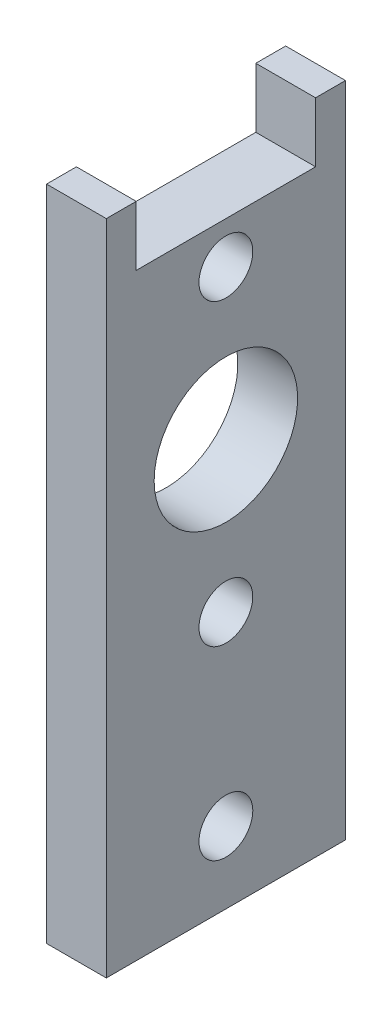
ISO-10303-21;
HEADER;
FILE_DESCRIPTION(('STEP AP214'),'2;1');
FILE_NAME('part.step','',(''),(''),'','','');
FILE_SCHEMA(('AUTOMOTIVE_DESIGN { 1 0 10303 214 1 1 1 1 }'));
ENDSEC;
DATA;
#1=APPLICATION_CONTEXT('core data for automotive mechanical design processes');
#2=APPLICATION_PROTOCOL_DEFINITION('international standard','automotive_design',2000,#1);
#3=PRODUCT_CONTEXT('',#1,'mechanical');
#4=PRODUCT('Part','Part','',(#3));
#5=PRODUCT_RELATED_PRODUCT_CATEGORY('part','',(#4));
#6=PRODUCT_DEFINITION_FORMATION('','',#4);
#7=PRODUCT_DEFINITION_CONTEXT('part definition',#1,'design');
#8=PRODUCT_DEFINITION('design','',#6,#7);
#9=PRODUCT_DEFINITION_SHAPE('','',#8);
#10=(LENGTH_UNIT() NAMED_UNIT(*) SI_UNIT(.MILLI.,.METRE.));
#11=(NAMED_UNIT(*) PLANE_ANGLE_UNIT() SI_UNIT($,.RADIAN.));
#12=(NAMED_UNIT(*) SI_UNIT($,.STERADIAN.) SOLID_ANGLE_UNIT());
#13=UNCERTAINTY_MEASURE_WITH_UNIT(LENGTH_MEASURE(1.E-05),#10,'distance_accuracy_value','');
#14=(GEOMETRIC_REPRESENTATION_CONTEXT(3) GLOBAL_UNCERTAINTY_ASSIGNED_CONTEXT((#13)) GLOBAL_UNIT_ASSIGNED_CONTEXT((#10,
#11,#12)) REPRESENTATION_CONTEXT('',''));
#15=CARTESIAN_POINT('',(0.,0.,0.));
#16=DIRECTION('',(0.,0.,1.));
#17=DIRECTION('',(1.,0.,0.));
#18=AXIS2_PLACEMENT_3D('',#15,#16,#17);
#19=CARTESIAN_POINT('',(-2.5,50.,-9.99999999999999));
#20=DIRECTION('',(1.,0.,0.));
#21=DIRECTION('',(0.,0.,-1.));
#22=AXIS2_PLACEMENT_3D('',#19,#20,#21);
#23=PLANE('',#22);
#24=DIRECTION('',(0.,1.,0.));
#25=VECTOR('',#24,1.);
#26=CARTESIAN_POINT('',(-2.5,50.,10.));
#27=LINE('',#26,#25);
#28=CARTESIAN_POINT('',(-2.5,0.,10.));
#29=VERTEX_POINT('',#28);
#30=CARTESIAN_POINT('',(-2.5,55.,10.));
#31=VERTEX_POINT('',#30);
#32=EDGE_CURVE('E90',#29,#31,#27,.T.);
#33=ORIENTED_EDGE('',*,*,#32,.T.);
#34=DIRECTION('',(0.,0.,1.));
#35=VECTOR('',#34,1.);
#36=CARTESIAN_POINT('',(-2.5,55.,0.));
#37=LINE('',#36,#35);
#38=CARTESIAN_POINT('',(-2.5,55.,7.50000000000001));
#39=VERTEX_POINT('',#38);
#40=EDGE_CURVE('E80',#39,#31,#37,.T.);
#41=ORIENTED_EDGE('',*,*,#40,.F.);
#42=DIRECTION('',(0.,1.,0.));
#43=VECTOR('',#42,1.);
#44=CARTESIAN_POINT('',(-2.5,55.,7.50000000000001));
#45=LINE('',#44,#43);
#46=CARTESIAN_POINT('',(-2.5,50.,7.50000000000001));
#47=VERTEX_POINT('',#46);
#48=EDGE_CURVE('E104',#39,#47,#45,.F.);
#49=ORIENTED_EDGE('',*,*,#48,.T.);
#50=DIRECTION('',(0.,0.,1.));
#51=VECTOR('',#50,1.);
#52=CARTESIAN_POINT('',(-2.5,50.,0.));
#53=LINE('',#52,#51);
#54=CARTESIAN_POINT('',(-2.5,50.,-7.49999999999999));
#55=VERTEX_POINT('',#54);
#56=EDGE_CURVE('E292',#55,#47,#53,.T.);
#57=ORIENTED_EDGE('',*,*,#56,.F.);
#58=DIRECTION('',(0.,1.,0.));
#59=VECTOR('',#58,1.);
#60=CARTESIAN_POINT('',(-2.5,55.,-7.49999999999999));
#61=LINE('',#60,#59);
#62=CARTESIAN_POINT('',(-2.5,55.,-7.49999999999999));
#63=VERTEX_POINT('',#62);
#64=EDGE_CURVE('E296',#55,#63,#61,.T.);
#65=ORIENTED_EDGE('',*,*,#64,.T.);
#66=DIRECTION('',(0.,0.,1.));
#67=VECTOR('',#66,1.);
#68=CARTESIAN_POINT('',(-2.5,55.,0.));
#69=LINE('',#68,#67);
#70=CARTESIAN_POINT('',(-2.5,55.,-9.99999999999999));
#71=VERTEX_POINT('',#70);
#72=EDGE_CURVE('E302',#71,#63,#69,.T.);
#73=ORIENTED_EDGE('',*,*,#72,.F.);
#74=DIRECTION('',(0.,1.,0.));
#75=VECTOR('',#74,1.);
#76=CARTESIAN_POINT('',(-2.5,50.,-9.99999999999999));
#77=LINE('',#76,#75);
#78=CARTESIAN_POINT('',(-2.5,0.,-9.99999999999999));
#79=VERTEX_POINT('',#78);
#80=EDGE_CURVE('E309',#71,#79,#77,.F.);
#81=ORIENTED_EDGE('',*,*,#80,.T.);
#82=DIRECTION('',(0.,0.,1.));
#83=VECTOR('',#82,1.);
#84=CARTESIAN_POINT('',(-2.5,0.,0.));
#85=LINE('',#84,#83);
#86=EDGE_CURVE('E94',#79,#29,#85,.T.);
#87=ORIENTED_EDGE('',*,*,#86,.T.);
#88=EDGE_LOOP('',(#33,#41,#49,#57,#65,#73,#81,#87));
#89=FACE_BOUND('',#88,.T.);
#90=CARTESIAN_POINT('',(-2.5,34.,0.));
#91=DIRECTION('',(-1.,0.,0.));
#92=DIRECTION('',(0.,0.,1.));
#93=AXIS2_PLACEMENT_3D('',#90,#91,#92);
#94=CIRCLE('',#93,6.);
#95=CARTESIAN_POINT('',(-2.5,34.,6.));
#96=VERTEX_POINT('',#95);
#97=EDGE_CURVE('E98',#96,#96,#94,.F.);
#98=ORIENTED_EDGE('',*,*,#97,.T.);
#99=EDGE_LOOP('',(#98));
#100=FACE_BOUND('',#99,.T.);
#101=CARTESIAN_POINT('',(-2.5,46.5,0.));
#102=DIRECTION('',(-1.,0.,0.));
#103=DIRECTION('',(0.,0.,1.));
#104=AXIS2_PLACEMENT_3D('',#101,#102,#103);
#105=CIRCLE('',#104,2.25);
#106=CARTESIAN_POINT('',(-2.5,46.5,2.25));
#107=VERTEX_POINT('',#106);
#108=EDGE_CURVE('E123',#107,#107,#105,.F.);
#109=ORIENTED_EDGE('',*,*,#108,.T.);
#110=EDGE_LOOP('',(#109));
#111=FACE_BOUND('',#110,.T.);
#112=CARTESIAN_POINT('',(-2.5,21.5,0.));
#113=DIRECTION('',(-1.,0.,0.));
#114=DIRECTION('',(0.,0.,1.));
#115=AXIS2_PLACEMENT_3D('',#112,#113,#114);
#116=CIRCLE('',#115,2.25);
#117=CARTESIAN_POINT('',(-2.5,21.5,2.25));
#118=VERTEX_POINT('',#117);
#119=EDGE_CURVE('E125',#118,#118,#116,.F.);
#120=ORIENTED_EDGE('',*,*,#119,.T.);
#121=EDGE_LOOP('',(#120));
#122=FACE_BOUND('',#121,.T.);
#123=CARTESIAN_POINT('',(-2.5,6.,0.));
#124=DIRECTION('',(1.,0.,0.));
#125=DIRECTION('',(0.,0.,-1.));
#126=AXIS2_PLACEMENT_3D('',#123,#124,#125);
#127=CIRCLE('',#126,2.25);
#128=CARTESIAN_POINT('',(-2.5,6.,-2.24999999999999));
#129=VERTEX_POINT('',#128);
#130=EDGE_CURVE('E20',#129,#129,#127,.T.);
#131=ORIENTED_EDGE('',*,*,#130,.T.);
#132=EDGE_LOOP('',(#131));
#133=FACE_BOUND('',#132,.T.);
#134=ADVANCED_FACE('F17',(#89,#100,#111,#122,#133),#23,.F.);
#135=CARTESIAN_POINT('',(-2.5,6.,0.));
#136=DIRECTION('',(1.,0.,0.));
#137=DIRECTION('',(0.,0.,-1.));
#138=AXIS2_PLACEMENT_3D('',#135,#136,#137);
#139=CYLINDRICAL_SURFACE('',#138,2.25);
#140=ORIENTED_EDGE('',*,*,#130,.F.);
#141=EDGE_LOOP('',(#140));
#142=FACE_BOUND('',#141,.T.);
#143=CARTESIAN_POINT('',(2.5,6.,0.));
#144=DIRECTION('',(1.,0.,0.));
#145=DIRECTION('',(0.,0.,-1.));
#146=AXIS2_PLACEMENT_3D('',#143,#144,#145);
#147=CIRCLE('',#146,2.25);
#148=CARTESIAN_POINT('',(2.5,6.,-2.24999999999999));
#149=VERTEX_POINT('',#148);
#150=EDGE_CURVE('E117',#149,#149,#147,.T.);
#151=ORIENTED_EDGE('',*,*,#150,.T.);
#152=EDGE_LOOP('',(#151));
#153=FACE_BOUND('',#152,.T.);
#154=ADVANCED_FACE('F133',(#142,#153),#139,.F.);
#155=CARTESIAN_POINT('',(2.5,21.5,0.));
#156=DIRECTION('',(-1.,0.,0.));
#157=DIRECTION('',(0.,0.,1.));
#158=AXIS2_PLACEMENT_3D('',#155,#156,#157);
#159=CYLINDRICAL_SURFACE('',#158,2.25);
#160=CARTESIAN_POINT('',(2.5,21.5,0.));
#161=DIRECTION('',(-1.,0.,0.));
#162=DIRECTION('',(0.,0.,1.));
#163=AXIS2_PLACEMENT_3D('',#160,#161,#162);
#164=CIRCLE('',#163,2.25);
#165=CARTESIAN_POINT('',(2.5,21.5,2.25));
#166=VERTEX_POINT('',#165);
#167=EDGE_CURVE('E114',#166,#166,#164,.F.);
#168=ORIENTED_EDGE('',*,*,#167,.T.);
#169=EDGE_LOOP('',(#168));
#170=FACE_BOUND('',#169,.T.);
#171=ORIENTED_EDGE('',*,*,#119,.F.);
#172=EDGE_LOOP('',(#171));
#173=FACE_BOUND('',#172,.T.);
#174=ADVANCED_FACE('F136',(#170,#173),#159,.F.);
#175=CARTESIAN_POINT('',(2.5,46.5,0.));
#176=DIRECTION('',(-1.,0.,0.));
#177=DIRECTION('',(0.,0.,1.));
#178=AXIS2_PLACEMENT_3D('',#175,#176,#177);
#179=CYLINDRICAL_SURFACE('',#178,2.25);
#180=CARTESIAN_POINT('',(2.5,46.5,0.));
#181=DIRECTION('',(-1.,0.,0.));
#182=DIRECTION('',(0.,0.,1.));
#183=AXIS2_PLACEMENT_3D('',#180,#181,#182);
#184=CIRCLE('',#183,2.25);
#185=CARTESIAN_POINT('',(2.5,46.5,2.25));
#186=VERTEX_POINT('',#185);
#187=EDGE_CURVE('E111',#186,#186,#184,.F.);
#188=ORIENTED_EDGE('',*,*,#187,.T.);
#189=EDGE_LOOP('',(#188));
#190=FACE_BOUND('',#189,.T.);
#191=ORIENTED_EDGE('',*,*,#108,.F.);
#192=EDGE_LOOP('',(#191));
#193=FACE_BOUND('',#192,.T.);
#194=ADVANCED_FACE('F179',(#190,#193),#179,.F.);
#195=CARTESIAN_POINT('',(2.5,34.,0.));
#196=DIRECTION('',(-1.,0.,0.));
#197=DIRECTION('',(0.,0.,1.));
#198=AXIS2_PLACEMENT_3D('',#195,#196,#197);
#199=CYLINDRICAL_SURFACE('',#198,6.);
#200=CARTESIAN_POINT('',(2.5,34.,0.));
#201=DIRECTION('',(-1.,0.,0.));
#202=DIRECTION('',(0.,0.,1.));
#203=AXIS2_PLACEMENT_3D('',#200,#201,#202);
#204=CIRCLE('',#203,6.);
#205=CARTESIAN_POINT('',(2.5,34.,6.));
#206=VERTEX_POINT('',#205);
#207=EDGE_CURVE('E108',#206,#206,#204,.F.);
#208=ORIENTED_EDGE('',*,*,#207,.T.);
#209=EDGE_LOOP('',(#208));
#210=FACE_BOUND('',#209,.T.);
#211=ORIENTED_EDGE('',*,*,#97,.F.);
#212=EDGE_LOOP('',(#211));
#213=FACE_BOUND('',#212,.T.);
#214=ADVANCED_FACE('F176',(#210,#213),#199,.F.);
#215=CARTESIAN_POINT('',(-2.5,50.,10.));
#216=DIRECTION('',(0.,0.,-1.));
#217=DIRECTION('',(-1.,0.,0.));
#218=AXIS2_PLACEMENT_3D('',#215,#216,#217);
#219=PLANE('',#218);
#220=DIRECTION('',(0.,1.,0.));
#221=VECTOR('',#220,1.);
#222=CARTESIAN_POINT('',(2.5,50.,10.));
#223=LINE('',#222,#221);
#224=CARTESIAN_POINT('',(2.5,0.,10.));
#225=VERTEX_POINT('',#224);
#226=CARTESIAN_POINT('',(2.5,55.,10.));
#227=VERTEX_POINT('',#226);
#228=EDGE_CURVE('E102',#225,#227,#223,.T.);
#229=ORIENTED_EDGE('',*,*,#228,.T.);
#230=DIRECTION('',(1.,0.,0.));
#231=VECTOR('',#230,1.);
#232=CARTESIAN_POINT('',(0.,55.,10.));
#233=LINE('',#232,#231);
#234=EDGE_CURVE('E87',#31,#227,#233,.T.);
#235=ORIENTED_EDGE('',*,*,#234,.F.);
#236=ORIENTED_EDGE('',*,*,#32,.F.);
#237=DIRECTION('',(1.,0.,0.));
#238=VECTOR('',#237,1.);
#239=CARTESIAN_POINT('',(0.,0.,10.));
#240=LINE('',#239,#238);
#241=EDGE_CURVE('E120',#29,#225,#240,.T.);
#242=ORIENTED_EDGE('',*,*,#241,.T.);
#243=EDGE_LOOP('',(#229,#235,#236,#242));
#244=FACE_BOUND('',#243,.T.);
#245=ADVANCED_FACE('F101',(#244),#219,.F.);
#246=CARTESIAN_POINT('',(0.,55.,0.));
#247=DIRECTION('',(0.,1.,0.));
#248=DIRECTION('',(0.,0.,1.));
#249=AXIS2_PLACEMENT_3D('',#246,#247,#248);
#250=PLANE('',#249);
#251=ORIENTED_EDGE('',*,*,#40,.T.);
#252=ORIENTED_EDGE('',*,*,#234,.T.);
#253=DIRECTION('',(0.,0.,1.));
#254=VECTOR('',#253,1.);
#255=CARTESIAN_POINT('',(2.5,55.,-9.99999999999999));
#256=LINE('',#255,#254);
#257=CARTESIAN_POINT('',(2.5,55.,7.50000000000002));
#258=VERTEX_POINT('',#257);
#259=EDGE_CURVE('E315',#227,#258,#256,.F.);
#260=ORIENTED_EDGE('',*,*,#259,.T.);
#261=DIRECTION('',(1.,0.,0.));
#262=VECTOR('',#261,1.);
#263=CARTESIAN_POINT('',(2.5,55.,7.50000000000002));
#264=LINE('',#263,#262);
#265=EDGE_CURVE('E89',#258,#39,#264,.F.);
#266=ORIENTED_EDGE('',*,*,#265,.T.);
#267=EDGE_LOOP('',(#251,#252,#260,#266));
#268=FACE_BOUND('',#267,.T.);
#269=ADVANCED_FACE('F84',(#268),#250,.T.);
#270=CARTESIAN_POINT('',(2.5,55.,7.50000000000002));
#271=DIRECTION('',(0.,0.,1.));
#272=DIRECTION('',(1.,0.,0.));
#273=AXIS2_PLACEMENT_3D('',#270,#271,#272);
#274=PLANE('',#273);
#275=ORIENTED_EDGE('',*,*,#48,.F.);
#276=ORIENTED_EDGE('',*,*,#265,.F.);
#277=DIRECTION('',(0.,1.,0.));
#278=VECTOR('',#277,1.);
#279=CARTESIAN_POINT('',(2.5,50.,7.50000000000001));
#280=LINE('',#279,#278);
#281=CARTESIAN_POINT('',(2.5,50.,7.50000000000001));
#282=VERTEX_POINT('',#281);
#283=EDGE_CURVE('E317',#258,#282,#280,.F.);
#284=ORIENTED_EDGE('',*,*,#283,.T.);
#285=DIRECTION('',(1.,0.,0.));
#286=VECTOR('',#285,1.);
#287=CARTESIAN_POINT('',(0.,50.,7.50000000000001));
#288=LINE('',#287,#286);
#289=EDGE_CURVE('E290',#47,#282,#288,.T.);
#290=ORIENTED_EDGE('',*,*,#289,.F.);
#291=EDGE_LOOP('',(#275,#276,#284,#290));
#292=FACE_BOUND('',#291,.T.);
#293=ADVANCED_FACE('F167',(#292),#274,.F.);
#294=CARTESIAN_POINT('',(0.,50.,0.));
#295=DIRECTION('',(0.,1.,0.));
#296=DIRECTION('',(0.,0.,1.));
#297=AXIS2_PLACEMENT_3D('',#294,#295,#296);
#298=PLANE('',#297);
#299=DIRECTION('',(0.,0.,1.));
#300=VECTOR('',#299,1.);
#301=CARTESIAN_POINT('',(2.5,50.,-9.99999999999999));
#302=LINE('',#301,#300);
#303=CARTESIAN_POINT('',(2.5,50.,-7.49999999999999));
#304=VERTEX_POINT('',#303);
#305=EDGE_CURVE('E319',#282,#304,#302,.F.);
#306=ORIENTED_EDGE('',*,*,#305,.T.);
#307=DIRECTION('',(-1.,0.,0.));
#308=VECTOR('',#307,1.);
#309=CARTESIAN_POINT('',(-2.5,50.,-7.49999999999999));
#310=LINE('',#309,#308);
#311=EDGE_CURVE('E299',#304,#55,#310,.T.);
#312=ORIENTED_EDGE('',*,*,#311,.T.);
#313=ORIENTED_EDGE('',*,*,#56,.T.);
#314=ORIENTED_EDGE('',*,*,#289,.T.);
#315=EDGE_LOOP('',(#306,#312,#313,#314));
#316=FACE_BOUND('',#315,.T.);
#317=ADVANCED_FACE('F163',(#316),#298,.T.);
#318=CARTESIAN_POINT('',(-2.5,55.,-7.49999999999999));
#319=DIRECTION('',(0.,0.,-1.));
#320=DIRECTION('',(-1.,0.,0.));
#321=AXIS2_PLACEMENT_3D('',#318,#319,#320);
#322=PLANE('',#321);
#323=DIRECTION('',(0.,1.,0.));
#324=VECTOR('',#323,1.);
#325=CARTESIAN_POINT('',(2.5,50.,-7.49999999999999));
#326=LINE('',#325,#324);
#327=CARTESIAN_POINT('',(2.5,55.,-7.49999999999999));
#328=VERTEX_POINT('',#327);
#329=EDGE_CURVE('E322',#304,#328,#326,.T.);
#330=ORIENTED_EDGE('',*,*,#329,.T.);
#331=DIRECTION('',(1.,0.,0.));
#332=VECTOR('',#331,1.);
#333=CARTESIAN_POINT('',(0.,55.,-7.49999999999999));
#334=LINE('',#333,#332);
#335=EDGE_CURVE('E304',#63,#328,#334,.T.);
#336=ORIENTED_EDGE('',*,*,#335,.F.);
#337=ORIENTED_EDGE('',*,*,#64,.F.);
#338=ORIENTED_EDGE('',*,*,#311,.F.);
#339=EDGE_LOOP('',(#330,#336,#337,#338));
#340=FACE_BOUND('',#339,.T.);
#341=ADVANCED_FACE('F159',(#340),#322,.F.);
#342=CARTESIAN_POINT('',(0.,55.,0.));
#343=DIRECTION('',(0.,1.,0.));
#344=DIRECTION('',(0.,0.,1.));
#345=AXIS2_PLACEMENT_3D('',#342,#343,#344);
#346=PLANE('',#345);
#347=DIRECTION('',(0.,0.,1.));
#348=VECTOR('',#347,1.);
#349=CARTESIAN_POINT('',(2.5,55.,-9.99999999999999));
#350=LINE('',#349,#348);
#351=CARTESIAN_POINT('',(2.5,55.,-9.99999999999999));
#352=VERTEX_POINT('',#351);
#353=EDGE_CURVE('E325',#328,#352,#350,.F.);
#354=ORIENTED_EDGE('',*,*,#353,.T.);
#355=DIRECTION('',(1.,0.,0.));
#356=VECTOR('',#355,1.);
#357=CARTESIAN_POINT('',(-2.5,55.,-9.99999999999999));
#358=LINE('',#357,#356);
#359=EDGE_CURVE('E306',#352,#71,#358,.F.);
#360=ORIENTED_EDGE('',*,*,#359,.T.);
#361=ORIENTED_EDGE('',*,*,#72,.T.);
#362=ORIENTED_EDGE('',*,*,#335,.T.);
#363=EDGE_LOOP('',(#354,#360,#361,#362));
#364=FACE_BOUND('',#363,.T.);
#365=ADVANCED_FACE('F155',(#364),#346,.T.);
#366=CARTESIAN_POINT('',(-2.5,50.,-9.99999999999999));
#367=DIRECTION('',(0.,0.,1.));
#368=DIRECTION('',(1.,0.,0.));
#369=AXIS2_PLACEMENT_3D('',#366,#367,#368);
#370=PLANE('',#369);
#371=ORIENTED_EDGE('',*,*,#80,.F.);
#372=ORIENTED_EDGE('',*,*,#359,.F.);
#373=DIRECTION('',(0.,1.,0.));
#374=VECTOR('',#373,1.);
#375=CARTESIAN_POINT('',(2.5,50.,-9.99999999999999));
#376=LINE('',#375,#374);
#377=CARTESIAN_POINT('',(2.5,0.,-9.99999999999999));
#378=VERTEX_POINT('',#377);
#379=EDGE_CURVE('E26',#352,#378,#376,.F.);
#380=ORIENTED_EDGE('',*,*,#379,.T.);
#381=DIRECTION('',(1.,0.,0.));
#382=VECTOR('',#381,1.);
#383=CARTESIAN_POINT('',(0.,0.,-9.99999999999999));
#384=LINE('',#383,#382);
#385=EDGE_CURVE('E34',#378,#79,#384,.F.);
#386=ORIENTED_EDGE('',*,*,#385,.T.);
#387=EDGE_LOOP('',(#371,#372,#380,#386));
#388=FACE_BOUND('',#387,.T.);
#389=ADVANCED_FACE('F148',(#388),#370,.F.);
#390=CARTESIAN_POINT('',(0.,0.,0.));
#391=DIRECTION('',(0.,1.,0.));
#392=DIRECTION('',(0.,0.,1.));
#393=AXIS2_PLACEMENT_3D('',#390,#391,#392);
#394=PLANE('',#393);
#395=ORIENTED_EDGE('',*,*,#241,.F.);
#396=ORIENTED_EDGE('',*,*,#86,.F.);
#397=ORIENTED_EDGE('',*,*,#385,.F.);
#398=DIRECTION('',(0.,0.,1.));
#399=VECTOR('',#398,1.);
#400=CARTESIAN_POINT('',(2.5,0.,-9.99999999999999));
#401=LINE('',#400,#399);
#402=EDGE_CURVE('E11',#378,#225,#401,.T.);
#403=ORIENTED_EDGE('',*,*,#402,.T.);
#404=EDGE_LOOP('',(#395,#396,#397,#403));
#405=FACE_BOUND('',#404,.T.);
#406=ADVANCED_FACE('F141',(#405),#394,.F.);
#407=CARTESIAN_POINT('',(2.5,50.,-9.99999999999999));
#408=DIRECTION('',(-1.,0.,0.));
#409=DIRECTION('',(0.,0.,1.));
#410=AXIS2_PLACEMENT_3D('',#407,#408,#409);
#411=PLANE('',#410);
#412=ORIENTED_EDGE('',*,*,#379,.F.);
#413=ORIENTED_EDGE('',*,*,#353,.F.);
#414=ORIENTED_EDGE('',*,*,#329,.F.);
#415=ORIENTED_EDGE('',*,*,#305,.F.);
#416=ORIENTED_EDGE('',*,*,#283,.F.);
#417=ORIENTED_EDGE('',*,*,#259,.F.);
#418=ORIENTED_EDGE('',*,*,#228,.F.);
#419=ORIENTED_EDGE('',*,*,#402,.F.);
#420=EDGE_LOOP('',(#412,#413,#414,#415,#416,#417,#418,#419));
#421=FACE_BOUND('',#420,.T.);
#422=ORIENTED_EDGE('',*,*,#207,.F.);
#423=EDGE_LOOP('',(#422));
#424=FACE_BOUND('',#423,.T.);
#425=ORIENTED_EDGE('',*,*,#187,.F.);
#426=EDGE_LOOP('',(#425));
#427=FACE_BOUND('',#426,.T.);
#428=ORIENTED_EDGE('',*,*,#167,.F.);
#429=EDGE_LOOP('',(#428));
#430=FACE_BOUND('',#429,.T.);
#431=ORIENTED_EDGE('',*,*,#150,.F.);
#432=EDGE_LOOP('',(#431));
#433=FACE_BOUND('',#432,.T.);
#434=ADVANCED_FACE('F139',(#421,#424,#427,#430,#433),#411,.F.);
#435=CLOSED_SHELL('',(#134,#154,#174,#194,#214,#245,#269,#293,#317,#341,#365,#389,#406,#434));
#436=MANIFOLD_SOLID_BREP('B1',#435);
#437=ADVANCED_BREP_SHAPE_REPRESENTATION('',(#18,#436),#14);
#438=SHAPE_DEFINITION_REPRESENTATION(#9,#437);
ENDSEC;
END-ISO-10303-21;
